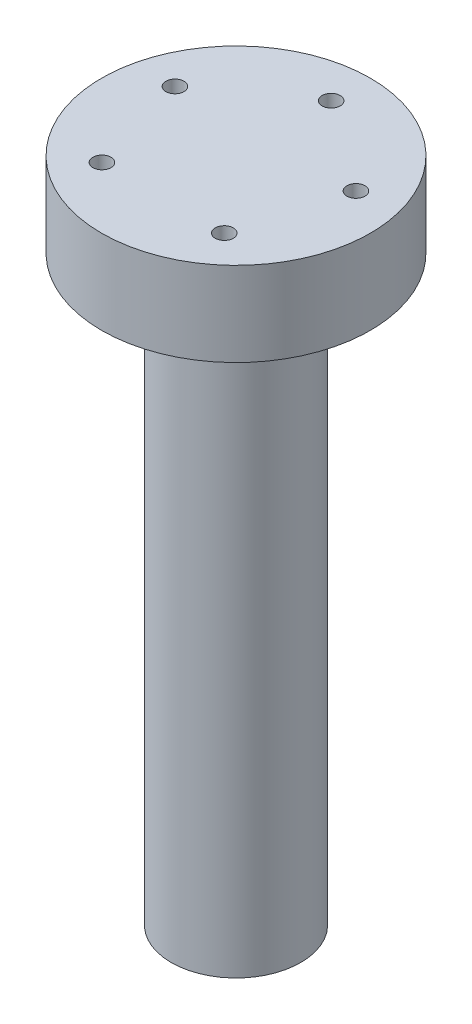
ISO-10303-21;
HEADER;
FILE_DESCRIPTION(('STEP AP214'),'2;1');
FILE_NAME('part.step','',(''),(''),'','','');
FILE_SCHEMA(('AUTOMOTIVE_DESIGN { 1 0 10303 214 1 1 1 1 }'));
ENDSEC;
DATA;
#1=APPLICATION_CONTEXT('core data for automotive mechanical design processes');
#2=APPLICATION_PROTOCOL_DEFINITION('international standard','automotive_design',2000,#1);
#3=PRODUCT_CONTEXT('',#1,'mechanical');
#4=PRODUCT('Part','Part','',(#3));
#5=PRODUCT_RELATED_PRODUCT_CATEGORY('part','',(#4));
#6=PRODUCT_DEFINITION_FORMATION('','',#4);
#7=PRODUCT_DEFINITION_CONTEXT('part definition',#1,'design');
#8=PRODUCT_DEFINITION('design','',#6,#7);
#9=PRODUCT_DEFINITION_SHAPE('','',#8);
#10=(LENGTH_UNIT() NAMED_UNIT(*) SI_UNIT(.MILLI.,.METRE.));
#11=(NAMED_UNIT(*) PLANE_ANGLE_UNIT() SI_UNIT($,.RADIAN.));
#12=(NAMED_UNIT(*) SI_UNIT($,.STERADIAN.) SOLID_ANGLE_UNIT());
#13=UNCERTAINTY_MEASURE_WITH_UNIT(LENGTH_MEASURE(1.E-05),#10,'distance_accuracy_value','');
#14=(GEOMETRIC_REPRESENTATION_CONTEXT(3) GLOBAL_UNCERTAINTY_ASSIGNED_CONTEXT((#13)) GLOBAL_UNIT_ASSIGNED_CONTEXT((#10,
#11,#12)) REPRESENTATION_CONTEXT('',''));
#15=CARTESIAN_POINT('',(0.,0.,0.));
#16=DIRECTION('',(0.,0.,1.));
#17=DIRECTION('',(1.,0.,0.));
#18=AXIS2_PLACEMENT_3D('',#15,#16,#17);
#19=CARTESIAN_POINT('',(0.,23.876,0.));
#20=DIRECTION('',(0.,-1.,0.));
#21=DIRECTION('',(0.,0.,-1.));
#22=AXIS2_PLACEMENT_3D('',#19,#20,#21);
#23=CYLINDRICAL_SURFACE('',#22,38.1);
#24=CARTESIAN_POINT('',(0.,23.876,0.));
#25=DIRECTION('',(0.,1.,0.));
#26=DIRECTION('',(0.,0.,1.));
#27=AXIS2_PLACEMENT_3D('',#24,#25,#26);
#28=CIRCLE('',#27,38.1);
#29=CARTESIAN_POINT('',(0.,23.876,38.1));
#30=VERTEX_POINT('',#29);
#31=EDGE_CURVE('E10',#30,#30,#28,.T.);
#32=ORIENTED_EDGE('',*,*,#31,.F.);
#33=EDGE_LOOP('',(#32));
#34=FACE_BOUND('',#33,.T.);
#35=CARTESIAN_POINT('',(0.,0.,0.));
#36=DIRECTION('',(0.,1.,0.));
#37=DIRECTION('',(0.,0.,1.));
#38=AXIS2_PLACEMENT_3D('',#35,#36,#37);
#39=CIRCLE('',#38,38.1);
#40=CARTESIAN_POINT('',(0.,0.,38.1));
#41=VERTEX_POINT('',#40);
#42=EDGE_CURVE('E34',#41,#41,#39,.T.);
#43=ORIENTED_EDGE('',*,*,#42,.T.);
#44=EDGE_LOOP('',(#43));
#45=FACE_BOUND('',#44,.T.);
#46=ADVANCED_FACE('F31',(#34,#45),#23,.T.);
#47=CARTESIAN_POINT('',(0.,23.876,0.));
#48=DIRECTION('',(0.,1.,0.));
#49=DIRECTION('',(0.,0.,1.));
#50=AXIS2_PLACEMENT_3D('',#47,#48,#49);
#51=PLANE('',#50);
#52=CARTESIAN_POINT('',(0.,23.876,-26.9875));
#53=DIRECTION('',(0.,1.,0.));
#54=DIRECTION('',(0.,0.,1.));
#55=AXIS2_PLACEMENT_3D('',#52,#53,#54);
#56=CIRCLE('',#55,2.5654);
#57=CARTESIAN_POINT('',(0.,23.876,-24.4221));
#58=VERTEX_POINT('',#57);
#59=EDGE_CURVE('E41',#58,#58,#56,.T.);
#60=ORIENTED_EDGE('',*,*,#59,.F.);
#61=EDGE_LOOP('',(#60));
#62=FACE_BOUND('',#61,.T.);
#63=CARTESIAN_POINT('',(25.6666377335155,23.876,-8.33959613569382));
#64=DIRECTION('',(0.,1.,0.));
#65=DIRECTION('',(0.,0.,1.));
#66=AXIS2_PLACEMENT_3D('',#63,#64,#65);
#67=CIRCLE('',#66,2.5654);
#68=CARTESIAN_POINT('',(25.6666377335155,23.876,-5.77419613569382));
#69=VERTEX_POINT('',#68);
#70=EDGE_CURVE('E45',#69,#69,#67,.T.);
#71=ORIENTED_EDGE('',*,*,#70,.F.);
#72=EDGE_LOOP('',(#71));
#73=FACE_BOUND('',#72,.T.);
#74=CARTESIAN_POINT('',(17.3472306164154,23.876,20.6736244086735));
#75=DIRECTION('',(0.,1.,0.));
#76=DIRECTION('',(0.,0.,1.));
#77=AXIS2_PLACEMENT_3D('',#74,#75,#76);
#78=CIRCLE('',#77,2.5654);
#79=CARTESIAN_POINT('',(17.3472306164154,23.876,23.2390244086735));
#80=VERTEX_POINT('',#79);
#81=EDGE_CURVE('E48',#80,#80,#78,.T.);
#82=ORIENTED_EDGE('',*,*,#81,.F.);
#83=EDGE_LOOP('',(#82));
#84=FACE_BOUND('',#83,.T.);
#85=CARTESIAN_POINT('',(-17.3472306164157,23.876,20.6736244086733));
#86=DIRECTION('',(0.,1.,0.));
#87=DIRECTION('',(0.,0.,1.));
#88=AXIS2_PLACEMENT_3D('',#85,#86,#87);
#89=CIRCLE('',#88,2.5654);
#90=CARTESIAN_POINT('',(-17.3472306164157,23.876,23.2390244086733));
#91=VERTEX_POINT('',#90);
#92=EDGE_CURVE('E51',#91,#91,#89,.T.);
#93=ORIENTED_EDGE('',*,*,#92,.F.);
#94=EDGE_LOOP('',(#93));
#95=FACE_BOUND('',#94,.T.);
#96=CARTESIAN_POINT('',(-25.6666377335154,23.876,-8.33959613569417));
#97=DIRECTION('',(0.,1.,0.));
#98=DIRECTION('',(0.,0.,1.));
#99=AXIS2_PLACEMENT_3D('',#96,#97,#98);
#100=CIRCLE('',#99,2.5654);
#101=CARTESIAN_POINT('',(-25.6666377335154,23.876,-5.77419613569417));
#102=VERTEX_POINT('',#101);
#103=EDGE_CURVE('E54',#102,#102,#100,.T.);
#104=ORIENTED_EDGE('',*,*,#103,.F.);
#105=EDGE_LOOP('',(#104));
#106=FACE_BOUND('',#105,.T.);
#107=ORIENTED_EDGE('',*,*,#31,.T.);
#108=EDGE_LOOP('',(#107));
#109=FACE_BOUND('',#108,.T.);
#110=ADVANCED_FACE('F91',(#62,#73,#84,#95,#106,#109),#51,.T.);
#111=CARTESIAN_POINT('',(0.,0.,0.));
#112=DIRECTION('',(0.,1.,0.));
#113=DIRECTION('',(0.,0.,1.));
#114=AXIS2_PLACEMENT_3D('',#111,#112,#113);
#115=PLANE('',#114);
#116=CARTESIAN_POINT('',(0.,0.,0.));
#117=DIRECTION('',(0.,1.,0.));
#118=DIRECTION('',(0.,0.,1.));
#119=AXIS2_PLACEMENT_3D('',#116,#117,#118);
#120=CIRCLE('',#119,18.37055);
#121=CARTESIAN_POINT('',(0.,0.,18.37055));
#122=VERTEX_POINT('',#121);
#123=EDGE_CURVE('E73',#122,#122,#120,.T.);
#124=ORIENTED_EDGE('',*,*,#123,.T.);
#125=EDGE_LOOP('',(#124));
#126=FACE_BOUND('',#125,.T.);
#127=CARTESIAN_POINT('',(0.,0.,-26.9875));
#128=DIRECTION('',(0.,1.,0.));
#129=DIRECTION('',(0.,0.,1.));
#130=AXIS2_PLACEMENT_3D('',#127,#128,#129);
#131=CIRCLE('',#130,2.5654);
#132=CARTESIAN_POINT('',(0.,0.,-24.4221));
#133=VERTEX_POINT('',#132);
#134=EDGE_CURVE('E57',#133,#133,#131,.T.);
#135=ORIENTED_EDGE('',*,*,#134,.T.);
#136=EDGE_LOOP('',(#135));
#137=FACE_BOUND('',#136,.T.);
#138=CARTESIAN_POINT('',(25.6666377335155,0.,-8.33959613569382));
#139=DIRECTION('',(0.,1.,0.));
#140=DIRECTION('',(0.,0.,1.));
#141=AXIS2_PLACEMENT_3D('',#138,#139,#140);
#142=CIRCLE('',#141,2.5654);
#143=CARTESIAN_POINT('',(25.6666377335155,0.,-5.77419613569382));
#144=VERTEX_POINT('',#143);
#145=EDGE_CURVE('E68',#144,#144,#142,.T.);
#146=ORIENTED_EDGE('',*,*,#145,.T.);
#147=EDGE_LOOP('',(#146));
#148=FACE_BOUND('',#147,.T.);
#149=CARTESIAN_POINT('',(17.3472306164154,0.,20.6736244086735));
#150=DIRECTION('',(0.,1.,0.));
#151=DIRECTION('',(0.,0.,1.));
#152=AXIS2_PLACEMENT_3D('',#149,#150,#151);
#153=CIRCLE('',#152,2.5654);
#154=CARTESIAN_POINT('',(17.3472306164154,0.,23.2390244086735));
#155=VERTEX_POINT('',#154);
#156=EDGE_CURVE('E65',#155,#155,#153,.T.);
#157=ORIENTED_EDGE('',*,*,#156,.T.);
#158=EDGE_LOOP('',(#157));
#159=FACE_BOUND('',#158,.T.);
#160=CARTESIAN_POINT('',(-17.3472306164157,0.,20.6736244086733));
#161=DIRECTION('',(0.,1.,0.));
#162=DIRECTION('',(0.,0.,1.));
#163=AXIS2_PLACEMENT_3D('',#160,#161,#162);
#164=CIRCLE('',#163,2.5654);
#165=CARTESIAN_POINT('',(-17.3472306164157,0.,23.2390244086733));
#166=VERTEX_POINT('',#165);
#167=EDGE_CURVE('E61',#166,#166,#164,.T.);
#168=ORIENTED_EDGE('',*,*,#167,.T.);
#169=EDGE_LOOP('',(#168));
#170=FACE_BOUND('',#169,.T.);
#171=CARTESIAN_POINT('',(-25.6666377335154,0.,-8.33959613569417));
#172=DIRECTION('',(0.,1.,0.));
#173=DIRECTION('',(0.,0.,1.));
#174=AXIS2_PLACEMENT_3D('',#171,#172,#173);
#175=CIRCLE('',#174,2.5654);
#176=CARTESIAN_POINT('',(-25.6666377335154,0.,-5.77419613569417));
#177=VERTEX_POINT('',#176);
#178=EDGE_CURVE('E58',#177,#177,#175,.T.);
#179=ORIENTED_EDGE('',*,*,#178,.T.);
#180=EDGE_LOOP('',(#179));
#181=FACE_BOUND('',#180,.T.);
#182=ORIENTED_EDGE('',*,*,#42,.F.);
#183=EDGE_LOOP('',(#182));
#184=FACE_BOUND('',#183,.T.);
#185=ADVANCED_FACE('F96',(#126,#137,#148,#159,#170,#181,#184),#115,.F.);
#186=CARTESIAN_POINT('',(-25.6666377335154,0.,-8.33959613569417));
#187=DIRECTION('',(0.,1.,0.));
#188=DIRECTION('',(0.,0.,1.));
#189=AXIS2_PLACEMENT_3D('',#186,#187,#188);
#190=CYLINDRICAL_SURFACE('',#189,2.5654);
#191=ORIENTED_EDGE('',*,*,#103,.T.);
#192=EDGE_LOOP('',(#191));
#193=FACE_BOUND('',#192,.T.);
#194=ORIENTED_EDGE('',*,*,#178,.F.);
#195=EDGE_LOOP('',(#194));
#196=FACE_BOUND('',#195,.T.);
#197=ADVANCED_FACE('F103',(#193,#196),#190,.F.);
#198=CARTESIAN_POINT('',(-17.3472306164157,0.,20.6736244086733));
#199=DIRECTION('',(0.,1.,0.));
#200=DIRECTION('',(0.,0.,1.));
#201=AXIS2_PLACEMENT_3D('',#198,#199,#200);
#202=CYLINDRICAL_SURFACE('',#201,2.5654);
#203=ORIENTED_EDGE('',*,*,#92,.T.);
#204=EDGE_LOOP('',(#203));
#205=FACE_BOUND('',#204,.T.);
#206=ORIENTED_EDGE('',*,*,#167,.F.);
#207=EDGE_LOOP('',(#206));
#208=FACE_BOUND('',#207,.T.);
#209=ADVANCED_FACE('F108',(#205,#208),#202,.F.);
#210=CARTESIAN_POINT('',(17.3472306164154,0.,20.6736244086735));
#211=DIRECTION('',(0.,1.,0.));
#212=DIRECTION('',(0.,0.,1.));
#213=AXIS2_PLACEMENT_3D('',#210,#211,#212);
#214=CYLINDRICAL_SURFACE('',#213,2.5654);
#215=ORIENTED_EDGE('',*,*,#81,.T.);
#216=EDGE_LOOP('',(#215));
#217=FACE_BOUND('',#216,.T.);
#218=ORIENTED_EDGE('',*,*,#156,.F.);
#219=EDGE_LOOP('',(#218));
#220=FACE_BOUND('',#219,.T.);
#221=ADVANCED_FACE('F115',(#217,#220),#214,.F.);
#222=CARTESIAN_POINT('',(25.6666377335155,0.,-8.33959613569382));
#223=DIRECTION('',(0.,1.,0.));
#224=DIRECTION('',(0.,0.,1.));
#225=AXIS2_PLACEMENT_3D('',#222,#223,#224);
#226=CYLINDRICAL_SURFACE('',#225,2.5654);
#227=ORIENTED_EDGE('',*,*,#70,.T.);
#228=EDGE_LOOP('',(#227));
#229=FACE_BOUND('',#228,.T.);
#230=ORIENTED_EDGE('',*,*,#145,.F.);
#231=EDGE_LOOP('',(#230));
#232=FACE_BOUND('',#231,.T.);
#233=ADVANCED_FACE('F119',(#229,#232),#226,.F.);
#234=CARTESIAN_POINT('',(0.,0.,-26.9875));
#235=DIRECTION('',(0.,1.,0.));
#236=DIRECTION('',(0.,0.,1.));
#237=AXIS2_PLACEMENT_3D('',#234,#235,#236);
#238=CYLINDRICAL_SURFACE('',#237,2.5654);
#239=ORIENTED_EDGE('',*,*,#59,.T.);
#240=EDGE_LOOP('',(#239));
#241=FACE_BOUND('',#240,.T.);
#242=ORIENTED_EDGE('',*,*,#134,.F.);
#243=EDGE_LOOP('',(#242));
#244=FACE_BOUND('',#243,.T.);
#245=ADVANCED_FACE('F88',(#241,#244),#238,.F.);
#246=CARTESIAN_POINT('',(0.,-165.1,0.));
#247=DIRECTION('',(0.,1.,0.));
#248=DIRECTION('',(0.,0.,1.));
#249=AXIS2_PLACEMENT_3D('',#246,#247,#248);
#250=CYLINDRICAL_SURFACE('',#249,18.37055);
#251=CARTESIAN_POINT('',(0.,-165.1,0.));
#252=DIRECTION('',(0.,1.,0.));
#253=DIRECTION('',(0.,0.,1.));
#254=AXIS2_PLACEMENT_3D('',#251,#252,#253);
#255=CIRCLE('',#254,18.37055);
#256=CARTESIAN_POINT('',(0.,-165.1,18.37055));
#257=VERTEX_POINT('',#256);
#258=EDGE_CURVE('E62',#257,#257,#255,.T.);
#259=ORIENTED_EDGE('',*,*,#258,.T.);
#260=EDGE_LOOP('',(#259));
#261=FACE_BOUND('',#260,.T.);
#262=ORIENTED_EDGE('',*,*,#123,.F.);
#263=EDGE_LOOP('',(#262));
#264=FACE_BOUND('',#263,.T.);
#265=ADVANCED_FACE('F79',(#261,#264),#250,.T.);
#266=CARTESIAN_POINT('',(0.,-165.1,0.));
#267=DIRECTION('',(0.,1.,0.));
#268=DIRECTION('',(0.,0.,1.));
#269=AXIS2_PLACEMENT_3D('',#266,#267,#268);
#270=PLANE('',#269);
#271=ORIENTED_EDGE('',*,*,#258,.F.);
#272=EDGE_LOOP('',(#271));
#273=FACE_BOUND('',#272,.T.);
#274=ADVANCED_FACE('F82',(#273),#270,.F.);
#275=CLOSED_SHELL('',(#46,#110,#185,#197,#209,#221,#233,#245,#265,#274));
#276=MANIFOLD_SOLID_BREP('B2',#275);
#277=ADVANCED_BREP_SHAPE_REPRESENTATION('',(#18,#276),#14);
#278=SHAPE_DEFINITION_REPRESENTATION(#9,#277);
ENDSEC;
END-ISO-10303-21;
